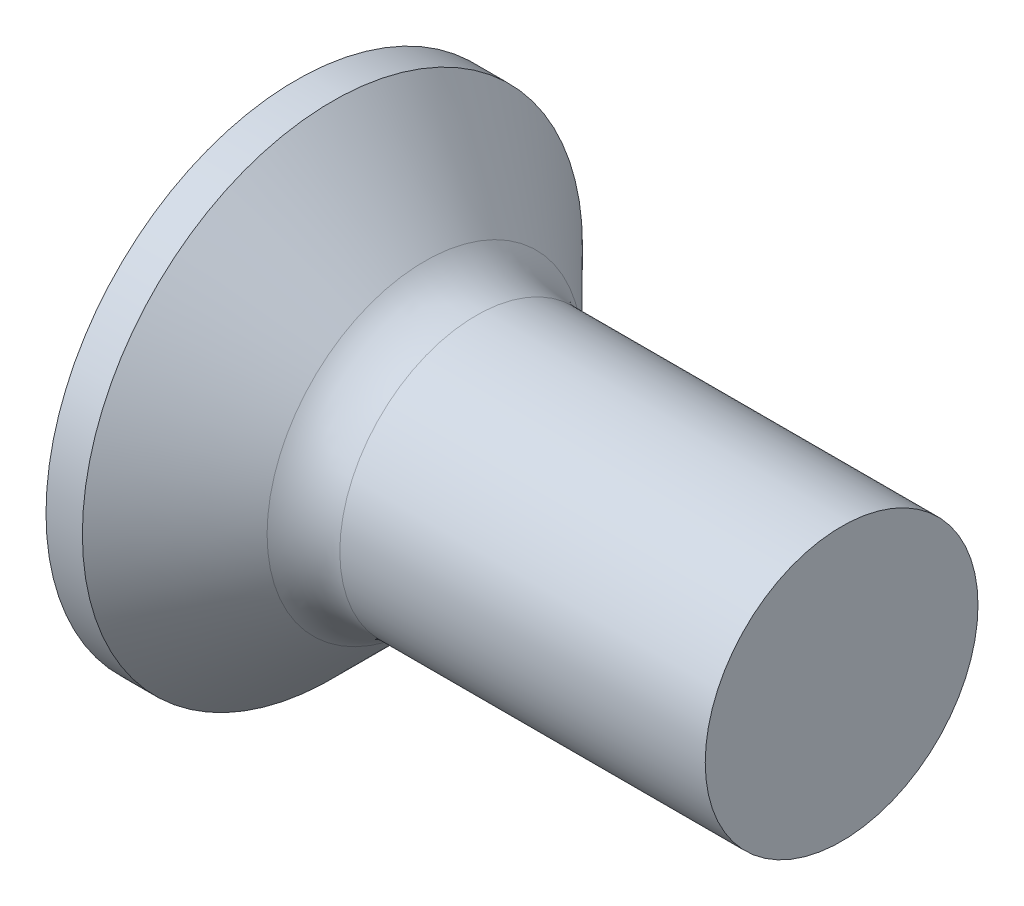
from build123d import *

# Parameters (mm, degrees)
FILLET1_R    = 0.8
RECPAT_COUNT = 2
RECPAT_ANGLE = 90


with BuildPart() as part:
    # BodySke → Base-Revolve (revolve)
    with BuildSketch(Plane.XY, mode=Mode.PRIVATE) as base_revolve_sk:
        Polygon((0, 0), (0, 2.75), (0.4, 2.75), (1.65, 1.5), (6, 1.5), (6, 0), align=None)
    revolve(base_revolve_sk.sketch.rotate(Axis((-6.35, 0, 0), (1, 0, 0)), 90), axis=Axis((-6.35, 0, 0), (1, 0, 0)))

    # Fillet1
    fillet1_edges = [part.edges().sort_by_distance(p)[0] for p in [
        (1.65, 0, -1.5),
    ]]
    fillet(fillet1_edges, radius=FILLET1_R)

    # Sketch3 → Recess section 0
    with BuildSketch(Plane.ZY):
        with BuildLine():
            Line((-0.37, 1.5), (0.37, 1.5))
            Line((0.37, 1.5), (0.37, -1.5))
            Line((0.37, -1.5), (-0.37, -1.5))
            Line((-0.37, -1.5), (-0.37, 1.5))
        make_face()
    # Sketch4 → Recess section 1
    with BuildSketch(Plane.ZY.offset(-2.01)):
        with BuildLine():
            Line((-0.37, 0.497851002), (0.37, 0.497851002))
            Line((0.37, 0.497851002), (0.37, -0.497851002))
            Line((0.37, -0.497851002), (-0.37, -0.497851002))
            Line((-0.37, -0.497851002), (-0.37, 0.497851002))
        make_face()
    recess = loft(mode=Mode.SUBTRACT)

    # RecPat: Recess ×2 about axis
    recpat_axis = Axis((0, 0, 0), (1, 0, 0))
    for i in range(1, RECPAT_COUNT):
        add(recess.rotate(recpat_axis, i * RECPAT_ANGLE / (RECPAT_COUNT - 1)), mode=Mode.SUBTRACT)

    # RecCorSke → RecessCore (revolve, cut)
    with BuildSketch(Plane.XY, mode=Mode.PRIVATE) as recesscore_sk:
        Polygon((0, 0), (0, 0.696552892), (2.01, 0.556), (2.190655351, 0), align=None)
    revolve(recesscore_sk.sketch.rotate(Axis((-3.175, 0, 0), (1, 0, 0)), 90), axis=Axis((-3.175, 0, 0), (1, 0, 0)), mode=Mode.SUBTRACT)


solid = part.part
